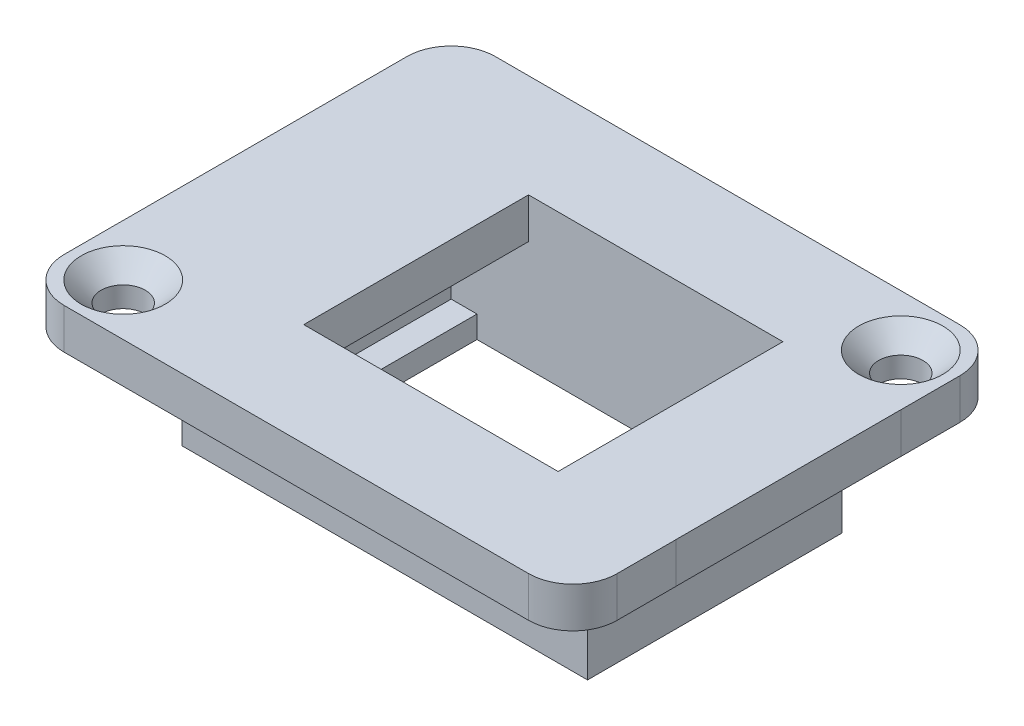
from build123d import *

# Parameters (mm, degrees)
BOSS_EXTRUDE1_DEPTH   = 15.25
BOSS_EXTRUDE1_2_DEPTH = 15.25
SKETCH2_W             = 37.506767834
SKETCH2_H             = 2.746604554
BOSS_EXTRUDE2_DEPTH   = 7
SKETCH3_W             = 37.506767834
SKETCH3_H             = 2.746604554
BOSS_EXTRUDE3_DEPTH   = 7
SKETCH9_R             = 1.5
CUT_EXTRUDE1_DEPTH    = 12
FILLET1_R             = 3
SKETCH11_W            = 27.5
SKETCH11_H            = 1
BOSS_EXTRUDE5_DEPTH   = 7.503395


with BuildPart() as part:
    # Sketch1 → Boss-Extrude1 (new body)
    with BuildSketch(Plane.XY):
        Polygon((10.25, -8), (10.25, -9.5), (13.75, -9.5), (13.75, -1.996604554), (18.75, -1.996604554), (18.75, 0.75), (10.753383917, 0.75), (10.753383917, -1.996604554), (11.75, -1.996604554), (11.75, -8), align=None)
    extrude(amount=BOSS_EXTRUDE1_DEPTH)



with BuildPart() as body_2:
    # Sketch1 → Boss-Extrude1 2 (new body)
    with BuildSketch(Plane.XY):
        Polygon((-11.75, -8), (-10, -8), (-10, -9.5), (-13.75, -9.5), (-13.75, -1.996604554), (-18.75, -1.996604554), (-18.75, 0.75), (-6.503383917, 0.75), (-6.503383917, -1.996604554), (-11.75, -1.996604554), align=None)
    extrude(amount=BOSS_EXTRUDE1_2_DEPTH)


with BuildPart() as part_1:
    add(part.part)

    add(body_2.part)  # Boss-Extrude2 merges body 2
    # Sketch2 → Boss-Extrude2 (add)
    with BuildSketch(Plane.XY.offset(15.25)):
        with Locations((0, -0.623302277)):
            Rectangle(SKETCH2_W, SKETCH2_H)
    extrude(amount=BOSS_EXTRUDE2_DEPTH)

    # Sketch3 → Boss-Extrude3 (add)
    with BuildSketch(Plane(origin=(0, 0, 0), x_dir=(-1, 0, 0), z_dir=(0, 0, -1))):
        with Locations((0, -0.623302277)):
            Rectangle(SKETCH3_W, SKETCH3_H)
    extrude(amount=BOSS_EXTRUDE3_DEPTH)

    # Sketch9 → Cut-Extrude1 (cut)
    with BuildSketch(Plane.XZ.offset(1.996604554)):
        with Locations(Location((-15.25, 18.75, 0), (0, 0, 270))):
            Circle(SKETCH9_R)
        with Locations(Location((15.25, -3.5, 0), (0, 0, 270))):
            Circle(SKETCH9_R)
    extrude(amount=-CUT_EXTRUDE1_DEPTH, mode=Mode.SUBTRACT)

    # Fillet1
    fillet1_edges = [part_1.edges().sort_by_distance(p)[0] for p in [
        (-18.753383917, -0.623302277, 22.25),
        (18.753383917, -0.623302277, 22.25),
        (18.753383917, -0.623302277, -7),
        (-18.753383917, -0.623302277, -7),
    ]]
    fillet(fillet1_edges, radius=FILLET1_R)

    # Cut-Extrude2 cone 1 section (on through the dimple's axis) → Cut-Extrude2 (revolve, cut)
    with BuildSketch(Plane(origin=(-15.25, 0.75, 18.75), x_dir=(0, 0, 1), z_dir=(1, 0, 0))):
        Polygon((0, 0), (2.85, 0), (0, 2.85), align=None)
    revolve(axis=Axis((-15.25, 0.75, 18.75), (0, -1, 0)), mode=Mode.SUBTRACT)

    # Cut-Extrude2 cone 2 section (on through the dimple's axis) → Cut-Extrude2 cone 2 (revolve, cut)
    with BuildSketch(Plane(origin=(15.25, 0.75, -3.5), x_dir=(0, 0, 1), z_dir=(1, 0, 0))):
        Polygon((0, 0), (2.85, 0), (0, 2.85), align=None)
    revolve(axis=Axis((15.25, 0.75, -3.5), (0, -1, 0)), mode=Mode.SUBTRACT)

    # Sketch11 → Boss-Extrude5 (add)
    with BuildSketch(Plane.XZ.offset(1.996604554)):
        with Locations((0, 15.75)):
            Rectangle(SKETCH11_W, SKETCH11_H)
        with Locations((0, -0.5)):
            Rectangle(SKETCH11_W, SKETCH11_H)
    extrude(amount=BOSS_EXTRUDE5_DEPTH)


solid = part_1.part
